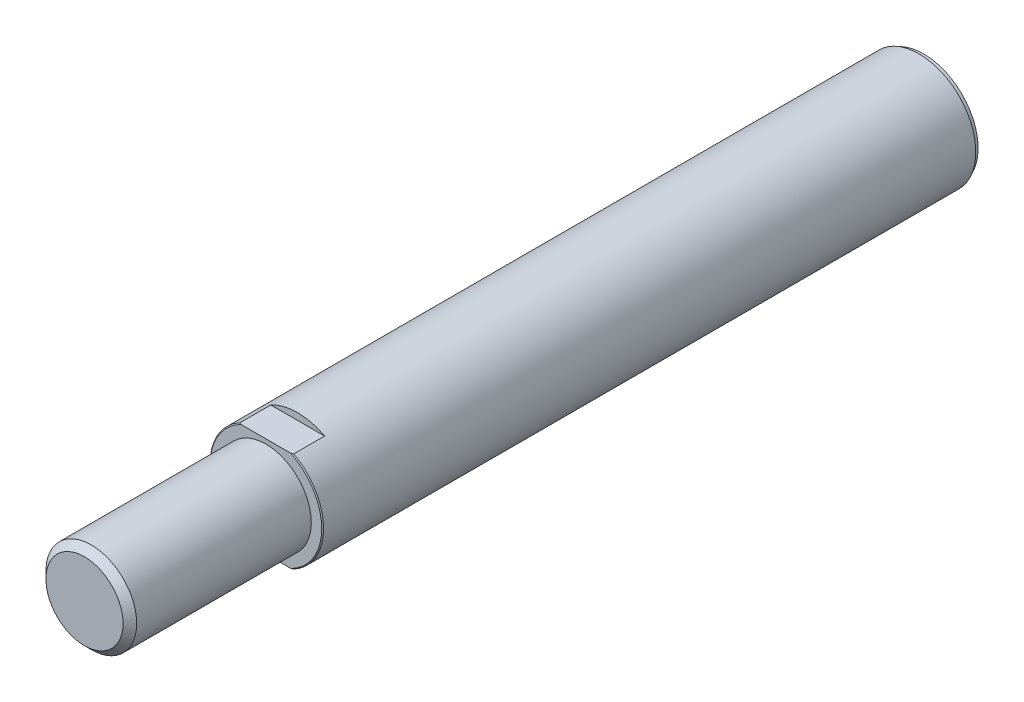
ISO-10303-21;
HEADER;
FILE_DESCRIPTION(('STEP AP214'),'2;1');
FILE_NAME('part.step','',(''),(''),'','','');
FILE_SCHEMA(('AUTOMOTIVE_DESIGN { 1 0 10303 214 1 1 1 1 }'));
ENDSEC;
DATA;
#1=APPLICATION_CONTEXT('core data for automotive mechanical design processes');
#2=APPLICATION_PROTOCOL_DEFINITION('international standard','automotive_design',2000,#1);
#3=PRODUCT_CONTEXT('',#1,'mechanical');
#4=PRODUCT('Part','Part','',(#3));
#5=PRODUCT_RELATED_PRODUCT_CATEGORY('part','',(#4));
#6=PRODUCT_DEFINITION_FORMATION('','',#4);
#7=PRODUCT_DEFINITION_CONTEXT('part definition',#1,'design');
#8=PRODUCT_DEFINITION('design','',#6,#7);
#9=PRODUCT_DEFINITION_SHAPE('','',#8);
#10=(LENGTH_UNIT() NAMED_UNIT(*) SI_UNIT(.MILLI.,.METRE.));
#11=(NAMED_UNIT(*) PLANE_ANGLE_UNIT() SI_UNIT($,.RADIAN.));
#12=(NAMED_UNIT(*) SI_UNIT($,.STERADIAN.) SOLID_ANGLE_UNIT());
#13=UNCERTAINTY_MEASURE_WITH_UNIT(LENGTH_MEASURE(1.E-05),#10,'distance_accuracy_value','');
#14=(GEOMETRIC_REPRESENTATION_CONTEXT(3) GLOBAL_UNCERTAINTY_ASSIGNED_CONTEXT((#13)) GLOBAL_UNIT_ASSIGNED_CONTEXT((#10,
#11,#12)) REPRESENTATION_CONTEXT('',''));
#15=CARTESIAN_POINT('',(0.,0.,0.));
#16=DIRECTION('',(0.,0.,1.));
#17=DIRECTION('',(1.,0.,0.));
#18=AXIS2_PLACEMENT_3D('',#15,#16,#17);
#19=CARTESIAN_POINT('',(0.,0.,185.));
#20=DIRECTION('',(0.,0.,-1.));
#21=DIRECTION('',(-1.,0.,0.));
#22=AXIS2_PLACEMENT_3D('',#19,#20,#21);
#23=CYLINDRICAL_SURFACE('',#22,12.5);
#24=DIRECTION('',(0.,0.,-1.));
#25=VECTOR('',#24,1.);
#26=CARTESIAN_POINT('',(-5.93717104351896,-11.,185.));
#27=LINE('',#26,#25);
#28=CARTESIAN_POINT('',(-5.93717104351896,-11.,144.8));
#29=VERTEX_POINT('',#28);
#30=CARTESIAN_POINT('',(-5.93717104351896,-11.,138.));
#31=VERTEX_POINT('',#30);
#32=EDGE_CURVE('E134',#29,#31,#27,.T.);
#33=ORIENTED_EDGE('',*,*,#32,.F.);
#34=CARTESIAN_POINT('',(0.,0.,144.8));
#35=DIRECTION('',(0.,0.,1.));
#36=DIRECTION('',(1.,0.,0.));
#37=AXIS2_PLACEMENT_3D('',#34,#35,#36);
#38=CIRCLE('',#37,12.5);
#39=CARTESIAN_POINT('',(-5.93717104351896,11.,144.8));
#40=VERTEX_POINT('',#39);
#41=EDGE_CURVE('E146',#29,#40,#38,.F.);
#42=ORIENTED_EDGE('',*,*,#41,.T.);
#43=DIRECTION('',(0.,0.,-1.));
#44=VECTOR('',#43,1.);
#45=CARTESIAN_POINT('',(-5.93717104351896,11.,185.));
#46=LINE('',#45,#44);
#47=CARTESIAN_POINT('',(-5.93717104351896,11.,138.));
#48=VERTEX_POINT('',#47);
#49=EDGE_CURVE('E58',#48,#40,#46,.F.);
#50=ORIENTED_EDGE('',*,*,#49,.F.);
#51=CARTESIAN_POINT('',(0.,0.,138.));
#52=DIRECTION('',(0.,0.,1.));
#53=DIRECTION('',(1.,0.,0.));
#54=AXIS2_PLACEMENT_3D('',#51,#52,#53);
#55=CIRCLE('',#54,12.5);
#56=CARTESIAN_POINT('',(5.93717104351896,11.,138.));
#57=VERTEX_POINT('',#56);
#58=EDGE_CURVE('E329',#57,#48,#55,.T.);
#59=ORIENTED_EDGE('',*,*,#58,.F.);
#60=DIRECTION('',(0.,0.,-1.));
#61=VECTOR('',#60,1.);
#62=CARTESIAN_POINT('',(5.93717104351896,11.,185.));
#63=LINE('',#62,#61);
#64=CARTESIAN_POINT('',(5.93717104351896,11.,144.8));
#65=VERTEX_POINT('',#64);
#66=EDGE_CURVE('E131',#65,#57,#63,.T.);
#67=ORIENTED_EDGE('',*,*,#66,.F.);
#68=CARTESIAN_POINT('',(5.93717104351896,-11.,144.8));
#69=VERTEX_POINT('',#68);
#70=EDGE_CURVE('E143',#65,#69,#38,.F.);
#71=ORIENTED_EDGE('',*,*,#70,.T.);
#72=DIRECTION('',(0.,0.,-1.));
#73=VECTOR('',#72,1.);
#74=CARTESIAN_POINT('',(5.93717104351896,-11.,185.));
#75=LINE('',#74,#73);
#76=CARTESIAN_POINT('',(5.93717104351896,-11.,138.));
#77=VERTEX_POINT('',#76);
#78=EDGE_CURVE('E66',#77,#69,#75,.F.);
#79=ORIENTED_EDGE('',*,*,#78,.F.);
#80=EDGE_CURVE('E332',#31,#77,#55,.T.);
#81=ORIENTED_EDGE('',*,*,#80,.F.);
#82=EDGE_LOOP('',(#33,#42,#50,#59,#67,#71,#79,#81));
#83=FACE_BOUND('',#82,.T.);
#84=CARTESIAN_POINT('',(0.,0.,1.));
#85=DIRECTION('',(0.,0.,-1.));
#86=DIRECTION('',(-1.,0.,0.));
#87=AXIS2_PLACEMENT_3D('',#84,#85,#86);
#88=CIRCLE('',#87,12.5);
#89=CARTESIAN_POINT('',(-12.5,0.,1.));
#90=VERTEX_POINT('',#89);
#91=EDGE_CURVE('E46',#90,#90,#88,.T.);
#92=ORIENTED_EDGE('',*,*,#91,.F.);
#93=EDGE_LOOP('',(#92));
#94=FACE_BOUND('',#93,.T.);
#95=ADVANCED_FACE('F42',(#83,#94),#23,.T.);
#96=CARTESIAN_POINT('',(0.,0.,145.));
#97=DIRECTION('',(0.,0.,1.));
#98=DIRECTION('',(1.,0.,0.));
#99=AXIS2_PLACEMENT_3D('',#96,#97,#98);
#100=PLANE('',#99);
#101=CARTESIAN_POINT('',(0.,0.,145.));
#102=DIRECTION('',(0.,0.,1.));
#103=DIRECTION('',(1.,0.,0.));
#104=AXIS2_PLACEMENT_3D('',#101,#102,#103);
#105=CIRCLE('',#104,10.);
#106=CARTESIAN_POINT('',(10.,0.,145.));
#107=VERTEX_POINT('',#106);
#108=EDGE_CURVE('E136',#107,#107,#105,.T.);
#109=ORIENTED_EDGE('',*,*,#108,.F.);
#110=EDGE_LOOP('',(#109));
#111=FACE_BOUND('',#110,.T.);
#112=CARTESIAN_POINT('',(0.,0.,145.));
#113=DIRECTION('',(0.,0.,1.));
#114=DIRECTION('',(1.,0.,0.));
#115=AXIS2_PLACEMENT_3D('',#112,#113,#114);
#116=CIRCLE('',#115,12.3);
#117=CARTESIAN_POINT('',(-5.50363516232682,11.,145.));
#118=VERTEX_POINT('',#117);
#119=CARTESIAN_POINT('',(-5.50363516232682,-11.,145.));
#120=VERTEX_POINT('',#119);
#121=EDGE_CURVE('E142',#118,#120,#116,.T.);
#122=ORIENTED_EDGE('',*,*,#121,.T.);
#123=DIRECTION('',(1.,0.,0.));
#124=VECTOR('',#123,1.);
#125=CARTESIAN_POINT('',(-18.9676132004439,-11.,145.));
#126=LINE('',#125,#124);
#127=CARTESIAN_POINT('',(5.50363516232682,-11.,145.));
#128=VERTEX_POINT('',#127);
#129=EDGE_CURVE('E123',#120,#128,#126,.T.);
#130=ORIENTED_EDGE('',*,*,#129,.T.);
#131=CARTESIAN_POINT('',(5.50363516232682,11.,145.));
#132=VERTEX_POINT('',#131);
#133=EDGE_CURVE('E139',#128,#132,#116,.T.);
#134=ORIENTED_EDGE('',*,*,#133,.T.);
#135=DIRECTION('',(-1.,0.,0.));
#136=VECTOR('',#135,1.);
#137=CARTESIAN_POINT('',(-18.9676132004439,11.,145.));
#138=LINE('',#137,#136);
#139=EDGE_CURVE('E125',#132,#118,#138,.T.);
#140=ORIENTED_EDGE('',*,*,#139,.T.);
#141=EDGE_LOOP('',(#122,#130,#134,#140));
#142=FACE_BOUND('',#141,.T.);
#143=ADVANCED_FACE('F183',(#111,#142),#100,.T.);
#144=CARTESIAN_POINT('',(0.,0.,145.));
#145=DIRECTION('',(0.,0.,-1.));
#146=DIRECTION('',(-1.,0.,0.));
#147=AXIS2_PLACEMENT_3D('',#144,#145,#146);
#148=CONICAL_SURFACE('',#147,12.3,0.785398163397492);
#149=ORIENTED_EDGE('',*,*,#41,.F.);
#150=CARTESIAN_POINT('',(-25.2049082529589,-11.,129.79932000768));
#151=CARTESIAN_POINT('',(-24.8332961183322,-11.,130.139899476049));
#152=CARTESIAN_POINT('',(-24.4610927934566,-11.,130.479835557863));
#153=CARTESIAN_POINT('',(-23.7153278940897,-11.,131.158220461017));
#154=CARTESIAN_POINT('',(-23.3417663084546,-11.,131.496669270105));
#155=CARTESIAN_POINT('',(-22.5930262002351,-11.,132.1719537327));
#156=CARTESIAN_POINT('',(-22.2178473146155,-11.,132.508788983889));
#157=CARTESIAN_POINT('',(-21.4657494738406,-11.,133.18051046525));
#158=CARTESIAN_POINT('',(-21.0888305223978,-11.,133.515396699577));
#159=CARTESIAN_POINT('',(-20.3305063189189,-11.,134.185120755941));
#160=CARTESIAN_POINT('',(-19.9490878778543,-11.,134.519943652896));
#161=CARTESIAN_POINT('',(-19.1839299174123,-11.,135.186926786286));
#162=CARTESIAN_POINT('',(-18.8001904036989,-11.,135.519087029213));
#163=CARTESIAN_POINT('',(-18.0300668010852,-11.,136.180238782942));
#164=CARTESIAN_POINT('',(-17.6436830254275,-11.,136.509230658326));
#165=CARTESIAN_POINT('',(-16.8677829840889,-11.,137.163501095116));
#166=CARTESIAN_POINT('',(-16.4782667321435,-11.,137.488779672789));
#167=CARTESIAN_POINT('',(-15.7614675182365,-11.,138.080475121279));
#168=CARTESIAN_POINT('',(-15.4347519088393,-11.,138.347578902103));
#169=CARTESIAN_POINT('',(-14.7783997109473,-11.,138.878171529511));
#170=CARTESIAN_POINT('',(-14.4487631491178,-11.,139.14166040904));
#171=CARTESIAN_POINT('',(-13.7860202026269,-11.,139.664443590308));
#172=CARTESIAN_POINT('',(-13.4529128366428,-11.,139.923736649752));
#173=CARTESIAN_POINT('',(-12.7827870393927,-11.,140.43722206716));
#174=CARTESIAN_POINT('',(-12.4457686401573,-11.,140.69141446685));
#175=CARTESIAN_POINT('',(-11.7675925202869,-11.,141.193346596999));
#176=CARTESIAN_POINT('',(-11.4264404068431,-11.,141.441093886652));
#177=CARTESIAN_POINT('',(-10.7388110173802,-11.,141.929138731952));
#178=CARTESIAN_POINT('',(-10.3923335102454,-11.,142.169435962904));
#179=CARTESIAN_POINT('',(-9.69333013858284,-11.,142.640735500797));
#180=CARTESIAN_POINT('',(-9.34080722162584,-11.,142.871742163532));
#181=CARTESIAN_POINT('',(-8.62854944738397,-11.,143.322311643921));
#182=CARTESIAN_POINT('',(-8.26881550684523,-11.,143.541875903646));
#183=CARTESIAN_POINT('',(-7.54622405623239,-11.,143.963558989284));
#184=CARTESIAN_POINT('',(-7.18348838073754,-11.,144.165885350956));
#185=CARTESIAN_POINT('',(-6.44862768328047,-11.,144.552951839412));
#186=CARTESIAN_POINT('',(-6.07650171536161,-11.,144.737690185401));
#187=CARTESIAN_POINT('',(-5.32234700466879,-11.,145.084623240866));
#188=CARTESIAN_POINT('',(-4.94033118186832,-11.,145.246845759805));
#189=CARTESIAN_POINT('',(-4.16548005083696,-11.,145.543160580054));
#190=CARTESIAN_POINT('',(-3.77264786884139,-11.,145.677260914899));
#191=CARTESIAN_POINT('',(-3.05749092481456,-11.,145.887010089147));
#192=CARTESIAN_POINT('',(-2.73703620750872,-11.,145.968998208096));
#193=CARTESIAN_POINT('',(-2.09063675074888,-11.,146.107537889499));
#194=CARTESIAN_POINT('',(-1.76469277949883,-11.,146.164092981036));
#195=CARTESIAN_POINT('',(-1.1099433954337,-11.,146.248894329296));
#196=CARTESIAN_POINT('',(-0.781147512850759,-11.,146.277213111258));
#197=CARTESIAN_POINT('',(-0.122326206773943,-11.,146.30424323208));
#198=CARTESIAN_POINT('',(0.207699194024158,-11.,146.302955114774));
#199=CARTESIAN_POINT('',(0.866187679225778,-11.,146.270850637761));
#200=CARTESIAN_POINT('',(1.19465120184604,-11.,146.240043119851));
#201=CARTESIAN_POINT('',(1.84773423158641,-11.,146.150587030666));
#202=CARTESIAN_POINT('',(2.17235340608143,-11.,146.091936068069));
#203=CARTESIAN_POINT('',(2.81692746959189,-11.,145.949408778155));
#204=CARTESIAN_POINT('',(3.13686596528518,-11.,145.865459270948));
#205=CARTESIAN_POINT('',(3.77013120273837,-11.,145.675776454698));
#206=CARTESIAN_POINT('',(4.08345803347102,-11.,145.570043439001));
#207=CARTESIAN_POINT('',(4.77959899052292,-11.,145.311847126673));
#208=CARTESIAN_POINT('',(5.16051287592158,-11.,145.154288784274));
#209=CARTESIAN_POINT('',(5.91217216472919,-11.,144.816371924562));
#210=CARTESIAN_POINT('',(6.28291247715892,-11.,144.636002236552));
#211=CARTESIAN_POINT('',(7.01572159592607,-11.,144.256923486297));
#212=CARTESIAN_POINT('',(7.37777248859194,-11.,144.058180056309));
#213=CARTESIAN_POINT('',(8.093543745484,-11.,143.646436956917));
#214=CARTESIAN_POINT('',(8.44726541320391,-11.,143.433439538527));
#215=CARTESIAN_POINT('',(9.15130038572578,-11.,142.993709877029));
#216=CARTESIAN_POINT('',(9.50153682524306,-11.,142.766855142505));
#217=CARTESIAN_POINT('',(10.1957742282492,-11.,142.303768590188));
#218=CARTESIAN_POINT('',(10.5397746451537,-11.,142.06753595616));
#219=CARTESIAN_POINT('',(11.2225281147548,-11.,141.587386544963));
#220=CARTESIAN_POINT('',(11.5612793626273,-11.,141.343467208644));
#221=CARTESIAN_POINT('',(12.2341678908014,-11.,140.849383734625));
#222=CARTESIAN_POINT('',(12.5683053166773,-11.,140.599219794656));
#223=CARTESIAN_POINT('',(13.4491244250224,-11.,139.928993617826));
#224=CARTESIAN_POINT('',(13.9924028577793,-11.,139.504460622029));
#225=CARTESIAN_POINT('',(15.0704026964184,-11.,138.644933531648));
#226=CARTESIAN_POINT('',(15.6051257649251,-11.,138.209941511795));
#227=CARTESIAN_POINT('',(16.6682135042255,-11.,137.331532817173));
#228=CARTESIAN_POINT('',(17.1965735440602,-11.,136.888110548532));
#229=CARTESIAN_POINT('',(18.2478896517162,-11.,135.99486689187));
#230=CARTESIAN_POINT('',(18.7708454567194,-11.,135.545045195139));
#231=CARTESIAN_POINT('',(19.7911752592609,-11.,134.658678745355));
#232=CARTESIAN_POINT('',(20.2887256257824,-11.,134.222336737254));
#233=CARTESIAN_POINT('',(21.2804238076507,-11.,133.345821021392));
#234=CARTESIAN_POINT('',(21.7745716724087,-11.,132.905647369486));
#235=CARTESIAN_POINT('',(22.7594616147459,-11.,132.022629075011));
#236=CARTESIAN_POINT('',(23.2502069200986,-11.,131.579788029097));
#237=CARTESIAN_POINT('',(24.2292721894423,-11.,130.6914346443));
#238=CARTESIAN_POINT('',(24.7175921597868,-11.,130.245922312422));
#239=CARTESIAN_POINT('',(25.2049082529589,-11.,129.79932000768));
#240=B_SPLINE_CURVE_WITH_KNOTS('',3,(#150,#151,#152,#153,#154,#155,#156,#157,#158,#159,#160,
#161,#162,#163,#164,#165,#166,#167,#168,#169,#170,#171,#172,#173,#174,#175,#176,#177,#178,#179,
#180,#181,#182,#183,#184,#185,#186,#187,#188,#189,#190,#191,#192,#193,#194,#195,#196,#197,#198,
#199,#200,#201,#202,#203,#204,#205,#206,#207,#208,#209,#210,#211,#212,#213,#214,#215,#216,#217,
#218,#219,#220,#221,#222,#223,#224,#225,#226,#227,#228,#229,#230,#231,#232,#233,#234,#235,#236,
#237,#238,#239),.UNSPECIFIED.,.F.,.F.,(4,2,2,2,2,2,2,2,2,2,2,2,2,2,2,2,2,2,2,2,2,2,2,2,2,2,2,2,
2,2,2,2,2,2,2,2,2,2,2,2,2,2,2,2,4),(0.,1.51222100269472,3.02445444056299,4.53704712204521,
6.0496365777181,7.57221518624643,9.09479008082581,10.6171876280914,12.1395785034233,
13.4055696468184,14.6715492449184,15.9378970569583,17.2042345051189,18.4690128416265,
19.733846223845,20.9980795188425,22.2621530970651,23.5078130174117,24.7535989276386,
25.9978321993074,27.2417095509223,28.2331520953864,29.2244570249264,30.2132091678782,
31.2019431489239,32.1903810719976,33.1789039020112,34.1703140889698,35.1617109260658,
36.3973752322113,37.6336470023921,38.8722798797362,40.110717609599,41.3623951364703,
42.6141818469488,43.8663898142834,45.1185581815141,47.1867976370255,49.2546301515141,
51.3238862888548,53.3932425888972,55.3785544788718,57.3638374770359,59.346868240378,
61.3298938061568),.UNSPECIFIED.);
#241=EDGE_CURVE('E325',#29,#120,#240,.T.);
#242=ORIENTED_EDGE('',*,*,#241,.T.);
#243=ORIENTED_EDGE('',*,*,#121,.F.);
#244=CARTESIAN_POINT('',(25.2049082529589,11.,129.79932000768));
#245=CARTESIAN_POINT('',(24.8332961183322,11.,130.139899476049));
#246=CARTESIAN_POINT('',(24.4610927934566,11.,130.479835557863));
#247=CARTESIAN_POINT('',(23.7153278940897,11.,131.158220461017));
#248=CARTESIAN_POINT('',(23.3417663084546,11.,131.496669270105));
#249=CARTESIAN_POINT('',(22.5930262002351,11.,132.1719537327));
#250=CARTESIAN_POINT('',(22.2178473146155,11.,132.508788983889));
#251=CARTESIAN_POINT('',(21.4657494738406,11.,133.18051046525));
#252=CARTESIAN_POINT('',(21.0888305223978,11.,133.515396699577));
#253=CARTESIAN_POINT('',(20.3305063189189,11.,134.185120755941));
#254=CARTESIAN_POINT('',(19.9490878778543,11.,134.519943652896));
#255=CARTESIAN_POINT('',(19.1839299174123,11.,135.186926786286));
#256=CARTESIAN_POINT('',(18.8001904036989,11.,135.519087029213));
#257=CARTESIAN_POINT('',(18.0300668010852,11.,136.180238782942));
#258=CARTESIAN_POINT('',(17.6436830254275,11.,136.509230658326));
#259=CARTESIAN_POINT('',(16.8677829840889,11.,137.163501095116));
#260=CARTESIAN_POINT('',(16.4782667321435,11.,137.488779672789));
#261=CARTESIAN_POINT('',(15.7614675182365,11.,138.080475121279));
#262=CARTESIAN_POINT('',(15.4347519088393,11.,138.347578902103));
#263=CARTESIAN_POINT('',(14.7783997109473,11.,138.878171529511));
#264=CARTESIAN_POINT('',(14.4487631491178,11.,139.14166040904));
#265=CARTESIAN_POINT('',(13.7860202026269,11.,139.664443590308));
#266=CARTESIAN_POINT('',(13.4529128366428,11.,139.923736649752));
#267=CARTESIAN_POINT('',(12.7827870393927,11.,140.43722206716));
#268=CARTESIAN_POINT('',(12.4457686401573,11.,140.69141446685));
#269=CARTESIAN_POINT('',(11.7675925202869,11.,141.193346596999));
#270=CARTESIAN_POINT('',(11.4264404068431,11.,141.441093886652));
#271=CARTESIAN_POINT('',(10.7388110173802,11.,141.929138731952));
#272=CARTESIAN_POINT('',(10.3923335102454,11.,142.169435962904));
#273=CARTESIAN_POINT('',(9.69333013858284,11.,142.640735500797));
#274=CARTESIAN_POINT('',(9.34080722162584,11.,142.871742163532));
#275=CARTESIAN_POINT('',(8.62854944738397,11.,143.322311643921));
#276=CARTESIAN_POINT('',(8.26881550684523,11.,143.541875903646));
#277=CARTESIAN_POINT('',(7.54622405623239,11.,143.963558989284));
#278=CARTESIAN_POINT('',(7.18348838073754,11.,144.165885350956));
#279=CARTESIAN_POINT('',(6.44862768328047,11.,144.552951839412));
#280=CARTESIAN_POINT('',(6.07650171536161,11.,144.737690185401));
#281=CARTESIAN_POINT('',(5.32234700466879,11.,145.084623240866));
#282=CARTESIAN_POINT('',(4.94033118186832,11.,145.246845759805));
#283=CARTESIAN_POINT('',(4.16548005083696,11.,145.543160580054));
#284=CARTESIAN_POINT('',(3.77264786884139,11.,145.677260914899));
#285=CARTESIAN_POINT('',(3.05749092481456,11.,145.887010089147));
#286=CARTESIAN_POINT('',(2.73703620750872,11.,145.968998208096));
#287=CARTESIAN_POINT('',(2.09063675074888,11.,146.107537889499));
#288=CARTESIAN_POINT('',(1.76469277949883,11.,146.164092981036));
#289=CARTESIAN_POINT('',(1.1099433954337,11.,146.248894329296));
#290=CARTESIAN_POINT('',(0.781147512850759,11.,146.277213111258));
#291=CARTESIAN_POINT('',(0.122326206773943,11.,146.30424323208));
#292=CARTESIAN_POINT('',(-0.207699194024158,11.,146.302955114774));
#293=CARTESIAN_POINT('',(-0.866187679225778,11.,146.270850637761));
#294=CARTESIAN_POINT('',(-1.19465120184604,11.,146.240043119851));
#295=CARTESIAN_POINT('',(-1.84773423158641,11.,146.150587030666));
#296=CARTESIAN_POINT('',(-2.17235340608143,11.,146.091936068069));
#297=CARTESIAN_POINT('',(-2.81692746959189,11.,145.949408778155));
#298=CARTESIAN_POINT('',(-3.13686596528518,11.,145.865459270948));
#299=CARTESIAN_POINT('',(-3.77013120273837,11.,145.675776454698));
#300=CARTESIAN_POINT('',(-4.08345803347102,11.,145.570043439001));
#301=CARTESIAN_POINT('',(-4.77959899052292,11.,145.311847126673));
#302=CARTESIAN_POINT('',(-5.16051287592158,11.,145.154288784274));
#303=CARTESIAN_POINT('',(-5.91217216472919,11.,144.816371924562));
#304=CARTESIAN_POINT('',(-6.28291247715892,11.,144.636002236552));
#305=CARTESIAN_POINT('',(-7.01572159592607,11.,144.256923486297));
#306=CARTESIAN_POINT('',(-7.37777248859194,11.,144.058180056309));
#307=CARTESIAN_POINT('',(-8.093543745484,11.,143.646436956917));
#308=CARTESIAN_POINT('',(-8.44726541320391,11.,143.433439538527));
#309=CARTESIAN_POINT('',(-9.15130038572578,11.,142.993709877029));
#310=CARTESIAN_POINT('',(-9.50153682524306,11.,142.766855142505));
#311=CARTESIAN_POINT('',(-10.1957742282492,11.,142.303768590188));
#312=CARTESIAN_POINT('',(-10.5397746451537,11.,142.06753595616));
#313=CARTESIAN_POINT('',(-11.2225281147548,11.,141.587386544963));
#314=CARTESIAN_POINT('',(-11.5612793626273,11.,141.343467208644));
#315=CARTESIAN_POINT('',(-12.2341678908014,11.,140.849383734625));
#316=CARTESIAN_POINT('',(-12.5683053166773,11.,140.599219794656));
#317=CARTESIAN_POINT('',(-13.4491244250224,11.,139.928993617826));
#318=CARTESIAN_POINT('',(-13.9924028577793,11.,139.504460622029));
#319=CARTESIAN_POINT('',(-15.0704026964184,11.,138.644933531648));
#320=CARTESIAN_POINT('',(-15.6051257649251,11.,138.209941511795));
#321=CARTESIAN_POINT('',(-16.6682135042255,11.,137.331532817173));
#322=CARTESIAN_POINT('',(-17.1965735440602,11.,136.888110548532));
#323=CARTESIAN_POINT('',(-18.2478896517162,11.,135.99486689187));
#324=CARTESIAN_POINT('',(-18.7708454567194,11.,135.545045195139));
#325=CARTESIAN_POINT('',(-19.7911752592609,11.,134.658678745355));
#326=CARTESIAN_POINT('',(-20.2887256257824,11.,134.222336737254));
#327=CARTESIAN_POINT('',(-21.2804238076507,11.,133.345821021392));
#328=CARTESIAN_POINT('',(-21.7745716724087,11.,132.905647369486));
#329=CARTESIAN_POINT('',(-22.7594616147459,11.,132.022629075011));
#330=CARTESIAN_POINT('',(-23.2502069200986,11.,131.579788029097));
#331=CARTESIAN_POINT('',(-24.2292721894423,11.,130.6914346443));
#332=CARTESIAN_POINT('',(-24.7175921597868,11.,130.245922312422));
#333=CARTESIAN_POINT('',(-25.2049082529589,11.,129.79932000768));
#334=B_SPLINE_CURVE_WITH_KNOTS('',3,(#244,#245,#246,#247,#248,#249,#250,#251,#252,#253,#254,
#255,#256,#257,#258,#259,#260,#261,#262,#263,#264,#265,#266,#267,#268,#269,#270,#271,#272,#273,
#274,#275,#276,#277,#278,#279,#280,#281,#282,#283,#284,#285,#286,#287,#288,#289,#290,#291,#292,
#293,#294,#295,#296,#297,#298,#299,#300,#301,#302,#303,#304,#305,#306,#307,#308,#309,#310,#311,
#312,#313,#314,#315,#316,#317,#318,#319,#320,#321,#322,#323,#324,#325,#326,#327,#328,#329,#330,
#331,#332,#333),.UNSPECIFIED.,.F.,.F.,(4,2,2,2,2,2,2,2,2,2,2,2,2,2,2,2,2,2,2,2,2,2,2,2,2,2,2,2,
2,2,2,2,2,2,2,2,2,2,2,2,2,2,2,2,4),(0.,1.51222100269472,3.02445444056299,4.53704712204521,
6.0496365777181,7.57221518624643,9.09479008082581,10.6171876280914,12.1395785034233,
13.4055696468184,14.6715492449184,15.9378970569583,17.2042345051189,18.4690128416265,
19.733846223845,20.9980795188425,22.2621530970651,23.5078130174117,24.7535989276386,
25.9978321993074,27.2417095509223,28.2331520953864,29.2244570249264,30.2132091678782,
31.2019431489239,32.1903810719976,33.1789039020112,34.1703140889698,35.1617109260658,
36.3973752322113,37.6336470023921,38.8722798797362,40.110717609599,41.3623951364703,
42.6141818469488,43.8663898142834,45.1185581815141,47.1867976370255,49.2546301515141,
51.3238862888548,53.3932425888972,55.3785544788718,57.3638374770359,59.346868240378,
61.3298938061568),.UNSPECIFIED.);
#335=EDGE_CURVE('E147',#118,#40,#334,.T.);
#336=ORIENTED_EDGE('',*,*,#335,.T.);
#337=EDGE_LOOP('',(#149,#242,#243,#336));
#338=FACE_BOUND('',#337,.T.);
#339=ADVANCED_FACE('F162',(#338),#148,.T.);
#340=ORIENTED_EDGE('',*,*,#133,.F.);
#341=EDGE_CURVE('E155',#128,#69,#240,.T.);
#342=ORIENTED_EDGE('',*,*,#341,.T.);
#343=ORIENTED_EDGE('',*,*,#70,.F.);
#344=EDGE_CURVE('E154',#65,#132,#334,.T.);
#345=ORIENTED_EDGE('',*,*,#344,.T.);
#346=EDGE_LOOP('',(#340,#342,#343,#345));
#347=FACE_BOUND('',#346,.T.);
#348=ADVANCED_FACE('F181',(#347),#148,.T.);
#349=CARTESIAN_POINT('',(0.,0.,145.));
#350=DIRECTION('',(0.,0.,1.));
#351=DIRECTION('',(1.,0.,0.));
#352=AXIS2_PLACEMENT_3D('',#349,#350,#351);
#353=CYLINDRICAL_SURFACE('',#352,10.);
#354=CARTESIAN_POINT('',(0.,0.,183.5));
#355=DIRECTION('',(0.,0.,1.));
#356=DIRECTION('',(1.,0.,0.));
#357=AXIS2_PLACEMENT_3D('',#354,#355,#356);
#358=CIRCLE('',#357,10.);
#359=CARTESIAN_POINT('',(10.,0.,183.5));
#360=VERTEX_POINT('',#359);
#361=EDGE_CURVE('E12',#360,#360,#358,.F.);
#362=ORIENTED_EDGE('',*,*,#361,.T.);
#363=EDGE_LOOP('',(#362));
#364=FACE_BOUND('',#363,.T.);
#365=ORIENTED_EDGE('',*,*,#108,.T.);
#366=EDGE_LOOP('',(#365));
#367=FACE_BOUND('',#366,.T.);
#368=ADVANCED_FACE('F178',(#364,#367),#353,.T.);
#369=CARTESIAN_POINT('',(0.,0.,185.));
#370=DIRECTION('',(0.,0.,1.));
#371=DIRECTION('',(1.,0.,0.));
#372=AXIS2_PLACEMENT_3D('',#369,#370,#371);
#373=PLANE('',#372);
#374=CARTESIAN_POINT('',(0.,0.,185.));
#375=DIRECTION('',(0.,0.,1.));
#376=DIRECTION('',(1.,0.,0.));
#377=AXIS2_PLACEMENT_3D('',#374,#375,#376);
#378=CIRCLE('',#377,8.50000000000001);
#379=CARTESIAN_POINT('',(8.50000000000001,0.,185.));
#380=VERTEX_POINT('',#379);
#381=EDGE_CURVE('E51',#380,#380,#378,.T.);
#382=ORIENTED_EDGE('',*,*,#381,.T.);
#383=EDGE_LOOP('',(#382));
#384=FACE_BOUND('',#383,.T.);
#385=ADVANCED_FACE('F170',(#384),#373,.T.);
#386=CARTESIAN_POINT('',(-18.9676132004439,11.,138.));
#387=DIRECTION('',(0.,1.,0.));
#388=DIRECTION('',(0.,0.,1.));
#389=AXIS2_PLACEMENT_3D('',#386,#387,#388);
#390=PLANE('',#389);
#391=ORIENTED_EDGE('',*,*,#66,.T.);
#392=DIRECTION('',(-1.,0.,0.));
#393=VECTOR('',#392,1.);
#394=CARTESIAN_POINT('',(-18.9676132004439,11.,138.));
#395=LINE('',#394,#393);
#396=EDGE_CURVE('E120',#57,#48,#395,.T.);
#397=ORIENTED_EDGE('',*,*,#396,.T.);
#398=ORIENTED_EDGE('',*,*,#49,.T.);
#399=ORIENTED_EDGE('',*,*,#335,.F.);
#400=ORIENTED_EDGE('',*,*,#139,.F.);
#401=ORIENTED_EDGE('',*,*,#344,.F.);
#402=EDGE_LOOP('',(#391,#397,#398,#399,#400,#401));
#403=FACE_BOUND('',#402,.T.);
#404=ADVANCED_FACE('F165',(#403),#390,.T.);
#405=CARTESIAN_POINT('',(0.,0.,138.));
#406=DIRECTION('',(0.,0.,1.));
#407=DIRECTION('',(1.,0.,0.));
#408=AXIS2_PLACEMENT_3D('',#405,#406,#407);
#409=PLANE('',#408);
#410=ORIENTED_EDGE('',*,*,#58,.T.);
#411=ORIENTED_EDGE('',*,*,#396,.F.);
#412=EDGE_LOOP('',(#410,#411));
#413=FACE_BOUND('',#412,.T.);
#414=ADVANCED_FACE('F169',(#413),#409,.T.);
#415=ORIENTED_EDGE('',*,*,#80,.T.);
#416=DIRECTION('',(1.,0.,0.));
#417=VECTOR('',#416,1.);
#418=CARTESIAN_POINT('',(-18.9676132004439,-11.,138.));
#419=LINE('',#418,#417);
#420=EDGE_CURVE('E122',#31,#77,#419,.T.);
#421=ORIENTED_EDGE('',*,*,#420,.F.);
#422=EDGE_LOOP('',(#415,#421));
#423=FACE_BOUND('',#422,.T.);
#424=ADVANCED_FACE('F176',(#423),#409,.T.);
#425=CARTESIAN_POINT('',(-18.9676132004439,-11.,138.));
#426=DIRECTION('',(0.,-1.,0.));
#427=DIRECTION('',(0.,0.,-1.));
#428=AXIS2_PLACEMENT_3D('',#425,#426,#427);
#429=PLANE('',#428);
#430=ORIENTED_EDGE('',*,*,#32,.T.);
#431=ORIENTED_EDGE('',*,*,#420,.T.);
#432=ORIENTED_EDGE('',*,*,#78,.T.);
#433=ORIENTED_EDGE('',*,*,#341,.F.);
#434=ORIENTED_EDGE('',*,*,#129,.F.);
#435=ORIENTED_EDGE('',*,*,#241,.F.);
#436=EDGE_LOOP('',(#430,#431,#432,#433,#434,#435));
#437=FACE_BOUND('',#436,.T.);
#438=ADVANCED_FACE('F171',(#437),#429,.T.);
#439=CARTESIAN_POINT('',(0.,0.,185.));
#440=DIRECTION('',(0.,0.,-1.));
#441=DIRECTION('',(-1.,0.,0.));
#442=AXIS2_PLACEMENT_3D('',#439,#440,#441);
#443=CONICAL_SURFACE('',#442,8.50000000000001,0.785398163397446);
#444=ORIENTED_EDGE('',*,*,#361,.F.);
#445=EDGE_LOOP('',(#444));
#446=FACE_BOUND('',#445,.T.);
#447=ORIENTED_EDGE('',*,*,#381,.F.);
#448=EDGE_LOOP('',(#447));
#449=FACE_BOUND('',#448,.T.);
#450=ADVANCED_FACE('F44',(#446,#449),#443,.T.);
#451=CARTESIAN_POINT('',(0.,0.,1.));
#452=DIRECTION('',(0.,0.,-1.));
#453=DIRECTION('',(-1.,0.,0.));
#454=AXIS2_PLACEMENT_3D('',#451,#452,#453);
#455=PLANE('',#454);
#456=CARTESIAN_POINT('',(0.,0.,1.));
#457=DIRECTION('',(0.,0.,-1.));
#458=DIRECTION('',(-1.,0.,0.));
#459=AXIS2_PLACEMENT_3D('',#456,#457,#458);
#460=CIRCLE('',#459,12.);
#461=CARTESIAN_POINT('',(-12.,0.,1.));
#462=VERTEX_POINT('',#461);
#463=EDGE_CURVE('E113',#462,#462,#460,.T.);
#464=ORIENTED_EDGE('',*,*,#463,.F.);
#465=EDGE_LOOP('',(#464));
#466=FACE_BOUND('',#465,.T.);
#467=ORIENTED_EDGE('',*,*,#91,.T.);
#468=EDGE_LOOP('',(#467));
#469=FACE_BOUND('',#468,.T.);
#470=ADVANCED_FACE('F205',(#466,#469),#455,.T.);
#471=CARTESIAN_POINT('',(0.,0.,1.));
#472=DIRECTION('',(0.,0.,-1.));
#473=DIRECTION('',(-1.,0.,0.));
#474=AXIS2_PLACEMENT_3D('',#471,#472,#473);
#475=CYLINDRICAL_SURFACE('',#474,12.);
#476=ORIENTED_EDGE('',*,*,#463,.T.);
#477=EDGE_LOOP('',(#476));
#478=FACE_BOUND('',#477,.T.);
#479=CARTESIAN_POINT('',(0.,0.,0.));
#480=DIRECTION('',(0.,0.,-1.));
#481=DIRECTION('',(-1.,0.,0.));
#482=AXIS2_PLACEMENT_3D('',#479,#480,#481);
#483=CIRCLE('',#482,12.);
#484=CARTESIAN_POINT('',(-12.,0.,0.));
#485=VERTEX_POINT('',#484);
#486=EDGE_CURVE('E109',#485,#485,#483,.T.);
#487=ORIENTED_EDGE('',*,*,#486,.F.);
#488=EDGE_LOOP('',(#487));
#489=FACE_BOUND('',#488,.T.);
#490=ADVANCED_FACE('F191',(#478,#489),#475,.T.);
#491=CARTESIAN_POINT('',(0.,0.,0.));
#492=DIRECTION('',(0.,0.,1.));
#493=DIRECTION('',(1.,0.,0.));
#494=AXIS2_PLACEMENT_3D('',#491,#492,#493);
#495=PLANE('',#494);
#496=CARTESIAN_POINT('',(0.,0.,0.));
#497=DIRECTION('',(0.,0.,-1.));
#498=DIRECTION('',(-1.,0.,0.));
#499=AXIS2_PLACEMENT_3D('',#496,#497,#498);
#500=CIRCLE('',#499,5.1);
#501=CARTESIAN_POINT('',(-5.1,0.,0.));
#502=VERTEX_POINT('',#501);
#503=EDGE_CURVE('E110',#502,#502,#500,.T.);
#504=ORIENTED_EDGE('',*,*,#503,.F.);
#505=EDGE_LOOP('',(#504));
#506=FACE_BOUND('',#505,.T.);
#507=ORIENTED_EDGE('',*,*,#486,.T.);
#508=EDGE_LOOP('',(#507));
#509=FACE_BOUND('',#508,.T.);
#510=ADVANCED_FACE('F103',(#506,#509),#495,.F.);
#511=CARTESIAN_POINT('',(0.,0.,32.75));
#512=DIRECTION('',(0.,0.,-1.));
#513=DIRECTION('',(-1.,0.,0.));
#514=AXIS2_PLACEMENT_3D('',#511,#512,#513);
#515=CONICAL_SURFACE('',#514,5.09999999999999,1.02974425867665);
#516=CARTESIAN_POINT('',(0.,0.,35.8143891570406));
#517=VERTEX_POINT('',#516);
#518=VERTEX_LOOP('',#517);
#519=FACE_BOUND('',#518,.T.);
#520=CARTESIAN_POINT('',(0.,0.,32.75));
#521=DIRECTION('',(0.,0.,-1.));
#522=DIRECTION('',(-1.,0.,0.));
#523=AXIS2_PLACEMENT_3D('',#520,#521,#522);
#524=CIRCLE('',#523,5.09999999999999);
#525=CARTESIAN_POINT('',(-5.09999999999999,0.,32.75));
#526=VERTEX_POINT('',#525);
#527=EDGE_CURVE('E107',#526,#526,#524,.T.);
#528=ORIENTED_EDGE('',*,*,#527,.T.);
#529=EDGE_LOOP('',(#528));
#530=FACE_BOUND('',#529,.T.);
#531=ADVANCED_FACE('F99',(#519,#530),#515,.F.);
#532=CARTESIAN_POINT('',(0.,0.,0.));
#533=DIRECTION('',(0.,0.,-1.));
#534=DIRECTION('',(-1.,0.,0.));
#535=AXIS2_PLACEMENT_3D('',#532,#533,#534);
#536=CYLINDRICAL_SURFACE('',#535,5.09999999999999);
#537=ORIENTED_EDGE('',*,*,#527,.F.);
#538=EDGE_LOOP('',(#537));
#539=FACE_BOUND('',#538,.T.);
#540=ORIENTED_EDGE('',*,*,#503,.T.);
#541=EDGE_LOOP('',(#540));
#542=FACE_BOUND('',#541,.T.);
#543=ADVANCED_FACE('F102',(#539,#542),#536,.F.);
#544=CLOSED_SHELL('',(#95,#143,#339,#348,#368,#385,#404,#414,#424,#438,#450,#470,#490,#510,#531,#543));
#545=MANIFOLD_SOLID_BREP('B2',#544);
#546=ADVANCED_BREP_SHAPE_REPRESENTATION('',(#18,#545),#14);
#547=SHAPE_DEFINITION_REPRESENTATION(#9,#546);
ENDSEC;
END-ISO-10303-21;
